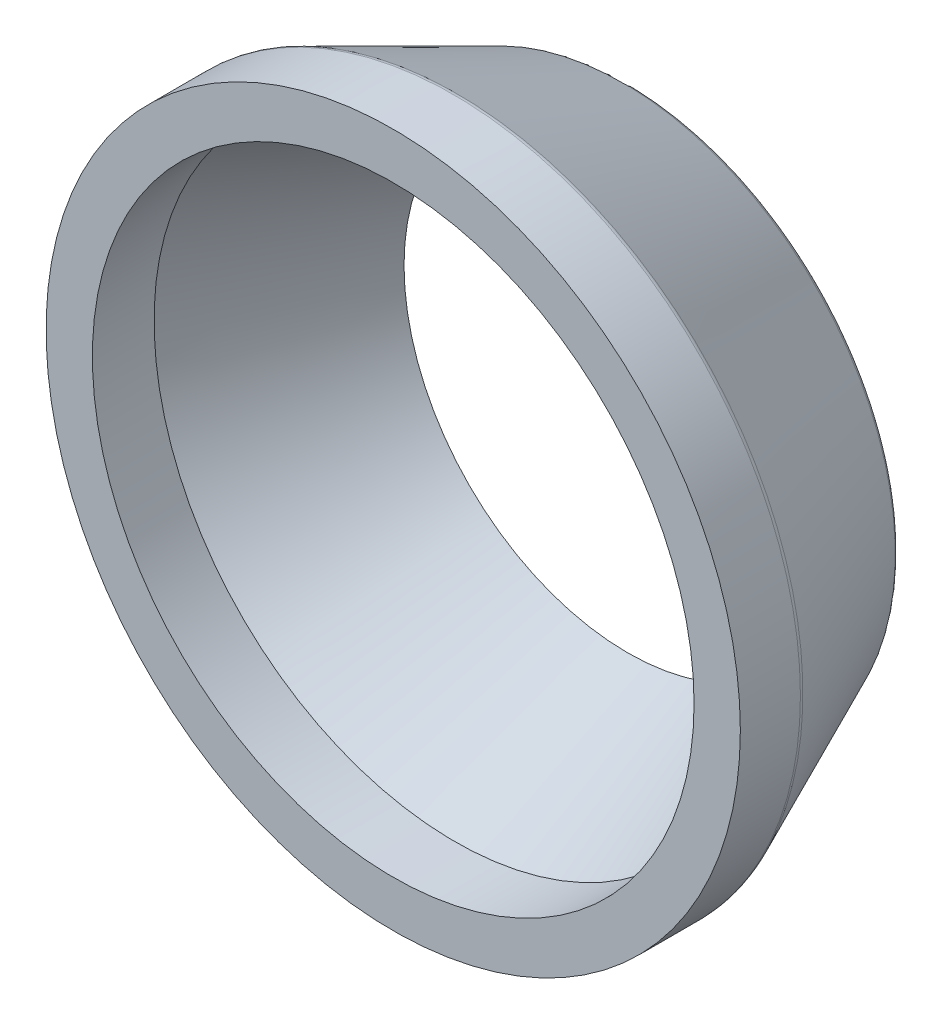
from build123d import *

# Parameters (mm, degrees)
FILLET1_R = 0.5


with BuildPart() as part:
    # Sketch1 → Revolve1 (revolve)
    with BuildSketch(Plane(origin=(0, 0, 0), x_dir=(1, 0, 0), z_dir=(0, 1, 0))):
        Polygon((22.5, 0), (22.5, 4), (17.5, 15.2), (14.5, 15.2), (19.5, 4), (19.5, 0), align=None)
    revolve(axis=Axis((0, 0, 16.8), (0, 0, -1)))

    # Fillet1
    fillet1_edges = [part.edges().sort_by_distance(p)[0] for p in [
        (-17.5, 0, -15.2),
        (-22.5, 0, -4),
    ]]
    fillet(fillet1_edges, radius=FILLET1_R)


solid = part.part
